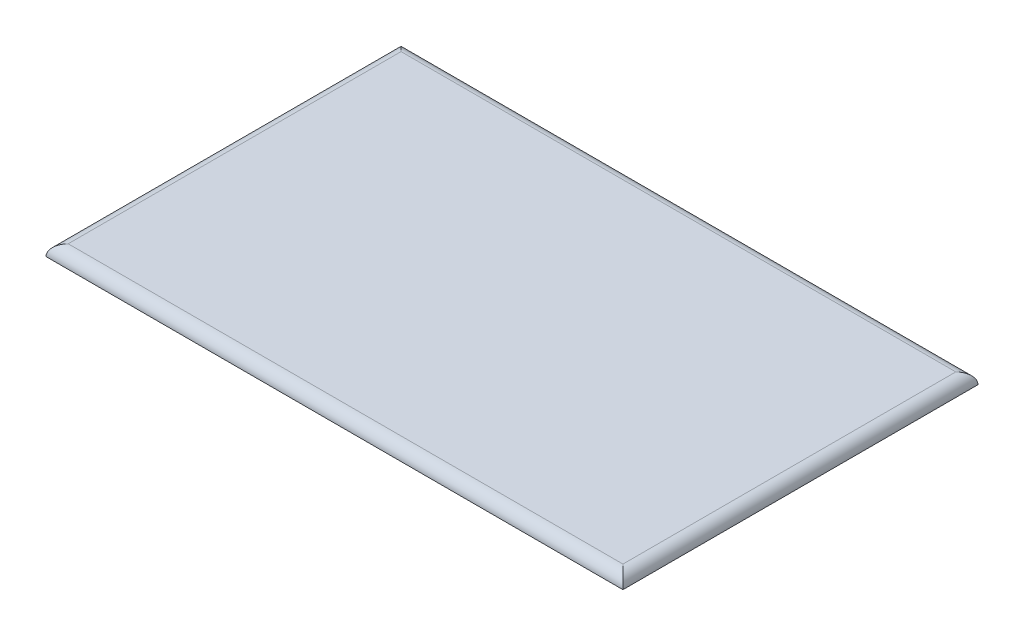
ISO-10303-21;
HEADER;
FILE_DESCRIPTION(('STEP AP214'),'2;1');
FILE_NAME('part.step','',(''),(''),'','','');
FILE_SCHEMA(('AUTOMOTIVE_DESIGN { 1 0 10303 214 1 1 1 1 }'));
ENDSEC;
DATA;
#1=APPLICATION_CONTEXT('core data for automotive mechanical design processes');
#2=APPLICATION_PROTOCOL_DEFINITION('international standard','automotive_design',2000,#1);
#3=PRODUCT_CONTEXT('',#1,'mechanical');
#4=PRODUCT('Part','Part','',(#3));
#5=PRODUCT_RELATED_PRODUCT_CATEGORY('part','',(#4));
#6=PRODUCT_DEFINITION_FORMATION('','',#4);
#7=PRODUCT_DEFINITION_CONTEXT('part definition',#1,'design');
#8=PRODUCT_DEFINITION('design','',#6,#7);
#9=PRODUCT_DEFINITION_SHAPE('','',#8);
#10=(LENGTH_UNIT() NAMED_UNIT(*) SI_UNIT(.MILLI.,.METRE.));
#11=(NAMED_UNIT(*) PLANE_ANGLE_UNIT() SI_UNIT($,.RADIAN.));
#12=(NAMED_UNIT(*) SI_UNIT($,.STERADIAN.) SOLID_ANGLE_UNIT());
#13=UNCERTAINTY_MEASURE_WITH_UNIT(LENGTH_MEASURE(1.E-05),#10,'distance_accuracy_value','');
#14=(GEOMETRIC_REPRESENTATION_CONTEXT(3) GLOBAL_UNCERTAINTY_ASSIGNED_CONTEXT((#13)) GLOBAL_UNIT_ASSIGNED_CONTEXT((#10,
#11,#12)) REPRESENTATION_CONTEXT('',''));
#15=CARTESIAN_POINT('',(0.,0.,0.));
#16=DIRECTION('',(0.,0.,1.));
#17=DIRECTION('',(1.,0.,0.));
#18=AXIS2_PLACEMENT_3D('',#15,#16,#17);
#19=CARTESIAN_POINT('',(0.,6.35,0.));
#20=DIRECTION('',(0.,-1.,0.));
#21=DIRECTION('',(0.,0.,-1.));
#22=AXIS2_PLACEMENT_3D('',#19,#20,#21);
#23=PLANE('',#22);
#24=DIRECTION('',(0.,0.,-1.));
#25=VECTOR('',#24,1.);
#26=CARTESIAN_POINT('',(158.75,6.35,0.));
#27=LINE('',#26,#25);
#28=CARTESIAN_POINT('',(158.75,6.35,95.25));
#29=VERTEX_POINT('',#28);
#30=CARTESIAN_POINT('',(158.75,6.35,-95.25));
#31=VERTEX_POINT('',#30);
#32=EDGE_CURVE('E49',#29,#31,#27,.T.);
#33=ORIENTED_EDGE('',*,*,#32,.T.);
#34=DIRECTION('',(-1.,0.,0.));
#35=VECTOR('',#34,1.);
#36=CARTESIAN_POINT('',(0.,6.35,-95.25));
#37=LINE('',#36,#35);
#38=CARTESIAN_POINT('',(-158.75,6.35,-95.2499999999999));
#39=VERTEX_POINT('',#38);
#40=EDGE_CURVE('E11',#31,#39,#37,.T.);
#41=ORIENTED_EDGE('',*,*,#40,.T.);
#42=DIRECTION('',(0.,0.,1.));
#43=VECTOR('',#42,1.);
#44=CARTESIAN_POINT('',(-158.75,6.35,0.));
#45=LINE('',#44,#43);
#46=CARTESIAN_POINT('',(-158.75,6.35,95.25));
#47=VERTEX_POINT('',#46);
#48=EDGE_CURVE('E111',#39,#47,#45,.T.);
#49=ORIENTED_EDGE('',*,*,#48,.T.);
#50=DIRECTION('',(1.,0.,0.));
#51=VECTOR('',#50,1.);
#52=CARTESIAN_POINT('',(0.,6.35,95.25));
#53=LINE('',#52,#51);
#54=EDGE_CURVE('E60',#47,#29,#53,.T.);
#55=ORIENTED_EDGE('',*,*,#54,.T.);
#56=EDGE_LOOP('',(#33,#41,#49,#55));
#57=FACE_BOUND('',#56,.T.);
#58=ADVANCED_FACE('F39',(#57),#23,.F.);
#59=CARTESIAN_POINT('',(0.,0.,0.));
#60=DIRECTION('',(0.,-1.,0.));
#61=DIRECTION('',(0.,0.,-1.));
#62=AXIS2_PLACEMENT_3D('',#59,#60,#61);
#63=PLANE('',#62);
#64=DIRECTION('',(0.,0.,1.));
#65=VECTOR('',#64,1.);
#66=CARTESIAN_POINT('',(-165.1,0.,-101.6));
#67=LINE('',#66,#65);
#68=CARTESIAN_POINT('',(-165.1,0.,-101.6));
#69=VERTEX_POINT('',#68);
#70=CARTESIAN_POINT('',(-165.1,0.,101.6));
#71=VERTEX_POINT('',#70);
#72=EDGE_CURVE('E85',#69,#71,#67,.T.);
#73=ORIENTED_EDGE('',*,*,#72,.F.);
#74=DIRECTION('',(-1.,0.,0.));
#75=VECTOR('',#74,1.);
#76=CARTESIAN_POINT('',(165.1,0.,-101.6));
#77=LINE('',#76,#75);
#78=CARTESIAN_POINT('',(165.1,0.,-101.6));
#79=VERTEX_POINT('',#78);
#80=EDGE_CURVE('E108',#79,#69,#77,.T.);
#81=ORIENTED_EDGE('',*,*,#80,.F.);
#82=DIRECTION('',(0.,0.,-1.));
#83=VECTOR('',#82,1.);
#84=CARTESIAN_POINT('',(165.1,0.,-101.6));
#85=LINE('',#84,#83);
#86=CARTESIAN_POINT('',(165.1,0.,101.6));
#87=VERTEX_POINT('',#86);
#88=EDGE_CURVE('E88',#87,#79,#85,.T.);
#89=ORIENTED_EDGE('',*,*,#88,.F.);
#90=DIRECTION('',(1.,0.,0.));
#91=VECTOR('',#90,1.);
#92=CARTESIAN_POINT('',(165.1,0.,101.6));
#93=LINE('',#92,#91);
#94=EDGE_CURVE('E80',#71,#87,#93,.T.);
#95=ORIENTED_EDGE('',*,*,#94,.F.);
#96=EDGE_LOOP('',(#73,#81,#89,#95));
#97=FACE_BOUND('',#96,.T.);
#98=ADVANCED_FACE('F82',(#97),#63,.T.);
#99=CARTESIAN_POINT('',(0.,0.,95.25));
#100=DIRECTION('',(1.,0.,0.));
#101=DIRECTION('',(0.,0.,-1.));
#102=AXIS2_PLACEMENT_3D('',#99,#100,#101);
#103=CYLINDRICAL_SURFACE('',#102,6.35);
#104=CARTESIAN_POINT('',(-158.75,0.,95.25));
#105=DIRECTION('',(0.707106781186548,0.,0.707106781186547));
#106=DIRECTION('',(-0.707106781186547,0.,0.707106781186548));
#107=AXIS2_PLACEMENT_3D('',#104,#105,#106);
#108=ELLIPSE('',#107,8.98025612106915,6.35);
#109=EDGE_CURVE('E94',#71,#47,#108,.F.);
#110=ORIENTED_EDGE('',*,*,#109,.F.);
#111=ORIENTED_EDGE('',*,*,#94,.T.);
#112=CARTESIAN_POINT('',(158.75,0.,95.25));
#113=DIRECTION('',(0.707106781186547,0.,-0.707106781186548));
#114=DIRECTION('',(0.707106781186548,0.,0.707106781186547));
#115=AXIS2_PLACEMENT_3D('',#112,#113,#114);
#116=ELLIPSE('',#115,8.98025612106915,6.35);
#117=EDGE_CURVE('E43',#29,#87,#116,.T.);
#118=ORIENTED_EDGE('',*,*,#117,.F.);
#119=ORIENTED_EDGE('',*,*,#54,.F.);
#120=EDGE_LOOP('',(#110,#111,#118,#119));
#121=FACE_BOUND('',#120,.T.);
#122=ADVANCED_FACE('F41',(#121),#103,.T.);
#123=CARTESIAN_POINT('',(158.75,0.,0.));
#124=DIRECTION('',(0.,0.,-1.));
#125=DIRECTION('',(-1.,0.,0.));
#126=AXIS2_PLACEMENT_3D('',#123,#124,#125);
#127=CYLINDRICAL_SURFACE('',#126,6.35);
#128=ORIENTED_EDGE('',*,*,#117,.T.);
#129=ORIENTED_EDGE('',*,*,#88,.T.);
#130=CARTESIAN_POINT('',(158.75,0.,-95.25));
#131=DIRECTION('',(-0.707106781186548,0.,-0.707106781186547));
#132=DIRECTION('',(0.707106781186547,0.,-0.707106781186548));
#133=AXIS2_PLACEMENT_3D('',#130,#131,#132);
#134=ELLIPSE('',#133,8.98025612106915,6.35);
#135=EDGE_CURVE('E98',#31,#79,#134,.T.);
#136=ORIENTED_EDGE('',*,*,#135,.F.);
#137=ORIENTED_EDGE('',*,*,#32,.F.);
#138=EDGE_LOOP('',(#128,#129,#136,#137));
#139=FACE_BOUND('',#138,.T.);
#140=ADVANCED_FACE('F125',(#139),#127,.T.);
#141=CARTESIAN_POINT('',(-158.75,0.,0.));
#142=DIRECTION('',(0.,0.,1.));
#143=DIRECTION('',(1.,0.,0.));
#144=AXIS2_PLACEMENT_3D('',#141,#142,#143);
#145=CYLINDRICAL_SURFACE('',#144,6.35);
#146=ORIENTED_EDGE('',*,*,#109,.T.);
#147=ORIENTED_EDGE('',*,*,#48,.F.);
#148=CARTESIAN_POINT('',(-158.75,0.,-95.2499999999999));
#149=DIRECTION('',(-0.707106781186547,0.,0.707106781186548));
#150=DIRECTION('',(0.707106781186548,0.,0.707106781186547));
#151=AXIS2_PLACEMENT_3D('',#148,#149,#150);
#152=ELLIPSE('',#151,8.98025612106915,6.35);
#153=EDGE_CURVE('E101',#69,#39,#152,.F.);
#154=ORIENTED_EDGE('',*,*,#153,.F.);
#155=ORIENTED_EDGE('',*,*,#72,.T.);
#156=EDGE_LOOP('',(#146,#147,#154,#155));
#157=FACE_BOUND('',#156,.T.);
#158=ADVANCED_FACE('F100',(#157),#145,.T.);
#159=CARTESIAN_POINT('',(0.,0.,-95.25));
#160=DIRECTION('',(-1.,0.,0.));
#161=DIRECTION('',(0.,0.,1.));
#162=AXIS2_PLACEMENT_3D('',#159,#160,#161);
#163=CYLINDRICAL_SURFACE('',#162,6.35);
#164=ORIENTED_EDGE('',*,*,#135,.T.);
#165=ORIENTED_EDGE('',*,*,#80,.T.);
#166=ORIENTED_EDGE('',*,*,#153,.T.);
#167=ORIENTED_EDGE('',*,*,#40,.F.);
#168=EDGE_LOOP('',(#164,#165,#166,#167));
#169=FACE_BOUND('',#168,.T.);
#170=ADVANCED_FACE('F123',(#169),#163,.T.);
#171=CLOSED_SHELL('',(#58,#98,#122,#140,#158,#170));
#172=MANIFOLD_SOLID_BREP('B2',#171);
#173=ADVANCED_BREP_SHAPE_REPRESENTATION('',(#18,#172),#14);
#174=SHAPE_DEFINITION_REPRESENTATION(#9,#173);
ENDSEC;
END-ISO-10303-21;
